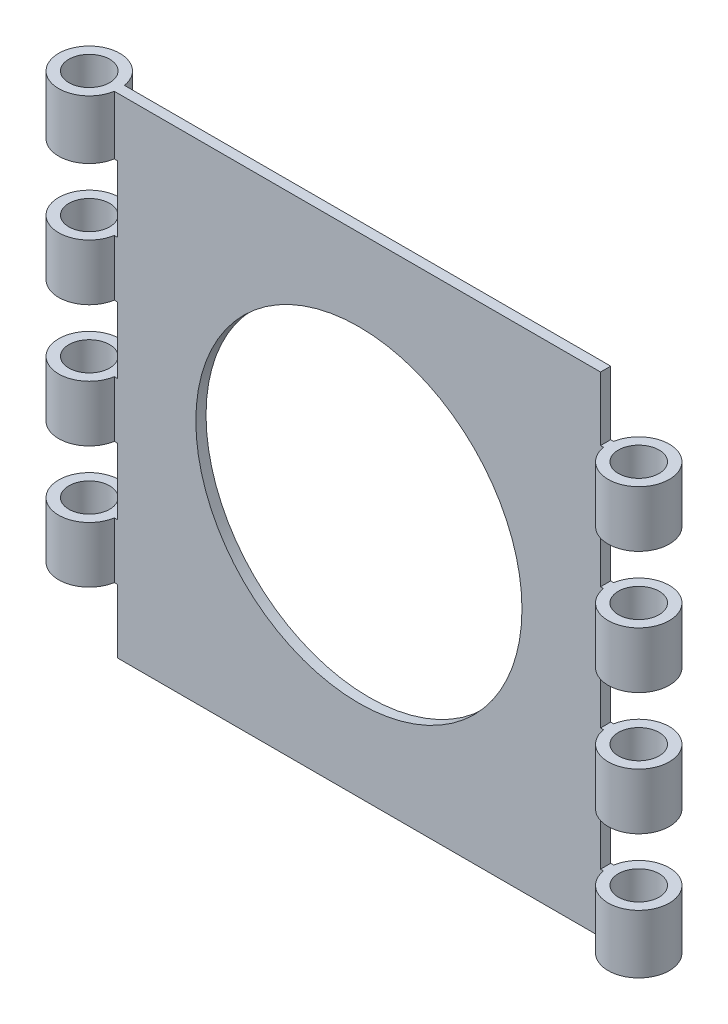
ISO-10303-21;
HEADER;
FILE_DESCRIPTION(('STEP AP214'),'2;1');
FILE_NAME('part.step','',(''),(''),'','','');
FILE_SCHEMA(('AUTOMOTIVE_DESIGN { 1 0 10303 214 1 1 1 1 }'));
ENDSEC;
DATA;
#1=APPLICATION_CONTEXT('core data for automotive mechanical design processes');
#2=APPLICATION_PROTOCOL_DEFINITION('international standard','automotive_design',2000,#1);
#3=PRODUCT_CONTEXT('',#1,'mechanical');
#4=PRODUCT('Part','Part','',(#3));
#5=PRODUCT_RELATED_PRODUCT_CATEGORY('part','',(#4));
#6=PRODUCT_DEFINITION_FORMATION('','',#4);
#7=PRODUCT_DEFINITION_CONTEXT('part definition',#1,'design');
#8=PRODUCT_DEFINITION('design','',#6,#7);
#9=PRODUCT_DEFINITION_SHAPE('','',#8);
#10=(LENGTH_UNIT() NAMED_UNIT(*) SI_UNIT(.MILLI.,.METRE.));
#11=(NAMED_UNIT(*) PLANE_ANGLE_UNIT() SI_UNIT($,.RADIAN.));
#12=(NAMED_UNIT(*) SI_UNIT($,.STERADIAN.) SOLID_ANGLE_UNIT());
#13=UNCERTAINTY_MEASURE_WITH_UNIT(LENGTH_MEASURE(1.E-05),#10,'distance_accuracy_value','');
#14=(GEOMETRIC_REPRESENTATION_CONTEXT(3) GLOBAL_UNCERTAINTY_ASSIGNED_CONTEXT((#13)) GLOBAL_UNIT_ASSIGNED_CONTEXT((#10,
#11,#12)) REPRESENTATION_CONTEXT('',''));
#15=CARTESIAN_POINT('',(0.,0.,0.));
#16=DIRECTION('',(0.,0.,1.));
#17=DIRECTION('',(1.,0.,0.));
#18=AXIS2_PLACEMENT_3D('',#15,#16,#17);
#19=CARTESIAN_POINT('',(-4.69588832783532,76.1999999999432,0.79375));
#20=DIRECTION('',(0.,-1.,0.));
#21=DIRECTION('',(0.,0.,-1.));
#22=AXIS2_PLACEMENT_3D('',#19,#20,#21);
#23=CYLINDRICAL_SURFACE('',#22,4.7625);
#24=DIRECTION('',(0.,1.,0.));
#25=VECTOR('',#24,1.);
#26=CARTESIAN_POINT('',(0.,0.,1.5875));
#27=LINE('',#26,#25);
#28=CARTESIAN_POINT('',(0.,48.0218750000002,1.5875));
#29=VERTEX_POINT('',#28);
#30=CARTESIAN_POINT('',(0.,56.7531250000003,1.5875));
#31=VERTEX_POINT('',#30);
#32=EDGE_CURVE('E535',#29,#31,#27,.T.);
#33=ORIENTED_EDGE('',*,*,#32,.T.);
#34=CARTESIAN_POINT('',(-4.69588832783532,56.7531250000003,0.79375));
#35=DIRECTION('',(0.,1.,0.));
#36=DIRECTION('',(-1.,0.,0.));
#37=AXIS2_PLACEMENT_3D('',#34,#35,#36);
#38=CIRCLE('',#37,4.7625);
#39=CARTESIAN_POINT('',(0.,56.7531250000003,0.));
#40=VERTEX_POINT('',#39);
#41=EDGE_CURVE('E517',#31,#40,#38,.F.);
#42=ORIENTED_EDGE('',*,*,#41,.T.);
#43=DIRECTION('',(0.,1.,0.));
#44=VECTOR('',#43,1.);
#45=CARTESIAN_POINT('',(0.,0.,0.));
#46=LINE('',#45,#44);
#47=CARTESIAN_POINT('',(0.,48.0218750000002,0.));
#48=VERTEX_POINT('',#47);
#49=EDGE_CURVE('E557',#48,#40,#46,.T.);
#50=ORIENTED_EDGE('',*,*,#49,.F.);
#51=CARTESIAN_POINT('',(-4.69588832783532,48.0218750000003,0.79375));
#52=DIRECTION('',(0.,-1.,0.));
#53=DIRECTION('',(1.,0.,0.));
#54=AXIS2_PLACEMENT_3D('',#51,#52,#53);
#55=CIRCLE('',#54,4.7625);
#56=EDGE_CURVE('E56',#48,#29,#55,.F.);
#57=ORIENTED_EDGE('',*,*,#56,.T.);
#58=EDGE_LOOP('',(#33,#42,#50,#57));
#59=FACE_BOUND('',#58,.T.);
#60=ADVANCED_FACE('F33',(#59),#23,.T.);
#61=CARTESIAN_POINT('',(-4.69588832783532,67.0718750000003,0.79375));
#62=DIRECTION('',(0.,-1.,0.));
#63=DIRECTION('',(1.,0.,0.));
#64=AXIS2_PLACEMENT_3D('',#61,#62,#63);
#65=CIRCLE('',#64,4.7625);
#66=CARTESIAN_POINT('',(0.,67.0718750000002,0.));
#67=VERTEX_POINT('',#66);
#68=CARTESIAN_POINT('',(0.,67.0718750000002,1.5875));
#69=VERTEX_POINT('',#68);
#70=EDGE_CURVE('E48',#67,#69,#65,.F.);
#71=ORIENTED_EDGE('',*,*,#70,.T.);
#72=CARTESIAN_POINT('',(0.,76.1999999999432,1.5875));
#73=VERTEX_POINT('',#72);
#74=EDGE_CURVE('E330',#69,#73,#27,.T.);
#75=ORIENTED_EDGE('',*,*,#74,.T.);
#76=CARTESIAN_POINT('',(-4.69588832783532,76.1999999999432,0.79375));
#77=DIRECTION('',(0.,-1.,0.));
#78=DIRECTION('',(0.,0.,-1.));
#79=AXIS2_PLACEMENT_3D('',#76,#77,#78);
#80=CIRCLE('',#79,4.7625);
#81=CARTESIAN_POINT('',(0.,76.2,0.));
#82=VERTEX_POINT('',#81);
#83=EDGE_CURVE('E349',#73,#82,#80,.T.);
#84=ORIENTED_EDGE('',*,*,#83,.T.);
#85=EDGE_CURVE('E345',#67,#82,#46,.T.);
#86=ORIENTED_EDGE('',*,*,#85,.F.);
#87=EDGE_LOOP('',(#71,#75,#84,#86));
#88=FACE_BOUND('',#87,.T.);
#89=ADVANCED_FACE('F561',(#88),#23,.T.);
#90=CARTESIAN_POINT('',(-4.69588832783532,76.2,0.79375));
#91=DIRECTION('',(0.,-1.,0.));
#92=DIRECTION('',(0.,0.,-1.));
#93=AXIS2_PLACEMENT_3D('',#90,#91,#92);
#94=CYLINDRICAL_SURFACE('',#93,3.175);
#95=CARTESIAN_POINT('',(-4.69588832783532,48.0218750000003,0.79375));
#96=DIRECTION('',(0.,-1.,0.));
#97=DIRECTION('',(1.,0.,0.));
#98=AXIS2_PLACEMENT_3D('',#95,#96,#97);
#99=CIRCLE('',#98,3.175);
#100=CARTESIAN_POINT('',(-1.52088832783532,48.0218750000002,0.79375));
#101=VERTEX_POINT('',#100);
#102=EDGE_CURVE('E499',#101,#101,#99,.F.);
#103=ORIENTED_EDGE('',*,*,#102,.F.);
#104=EDGE_LOOP('',(#103));
#105=FACE_BOUND('',#104,.T.);
#106=CARTESIAN_POINT('',(-4.69588832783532,56.7531250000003,0.79375));
#107=DIRECTION('',(0.,1.,0.));
#108=DIRECTION('',(-1.,0.,0.));
#109=AXIS2_PLACEMENT_3D('',#106,#107,#108);
#110=CIRCLE('',#109,3.175);
#111=CARTESIAN_POINT('',(-7.87088832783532,56.7531250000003,0.79375));
#112=VERTEX_POINT('',#111);
#113=EDGE_CURVE('E512',#112,#112,#110,.F.);
#114=ORIENTED_EDGE('',*,*,#113,.F.);
#115=EDGE_LOOP('',(#114));
#116=FACE_BOUND('',#115,.T.);
#117=ADVANCED_FACE('F563',(#105,#116),#94,.F.);
#118=CARTESIAN_POINT('',(-4.69588832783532,76.2,0.79375));
#119=DIRECTION('',(0.,-1.,0.));
#120=DIRECTION('',(0.,0.,-1.));
#121=AXIS2_PLACEMENT_3D('',#118,#119,#120);
#122=CIRCLE('',#121,3.175);
#123=CARTESIAN_POINT('',(-4.69588832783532,76.2,-2.38125));
#124=VERTEX_POINT('',#123);
#125=EDGE_CURVE('E361',#124,#124,#122,.T.);
#126=ORIENTED_EDGE('',*,*,#125,.F.);
#127=EDGE_LOOP('',(#126));
#128=FACE_BOUND('',#127,.T.);
#129=CARTESIAN_POINT('',(-4.69588832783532,67.0718750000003,0.79375));
#130=DIRECTION('',(0.,-1.,0.));
#131=DIRECTION('',(1.,0.,0.));
#132=AXIS2_PLACEMENT_3D('',#129,#130,#131);
#133=CIRCLE('',#132,3.175);
#134=CARTESIAN_POINT('',(-1.52088832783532,67.0718750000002,0.79375));
#135=VERTEX_POINT('',#134);
#136=EDGE_CURVE('E519',#135,#135,#133,.F.);
#137=ORIENTED_EDGE('',*,*,#136,.F.);
#138=EDGE_LOOP('',(#137));
#139=FACE_BOUND('',#138,.T.);
#140=ADVANCED_FACE('F569',(#128,#139),#94,.F.);
#141=CARTESIAN_POINT('',(0.,0.,1.5875));
#142=DIRECTION('',(0.,0.,-1.));
#143=DIRECTION('',(-1.,0.,0.));
#144=AXIS2_PLACEMENT_3D('',#141,#142,#143);
#145=PLANE('',#144);
#146=CARTESIAN_POINT('',(38.1000000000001,38.1,1.5875));
#147=DIRECTION('',(0.,0.,-1.));
#148=DIRECTION('',(-1.,0.,0.));
#149=AXIS2_PLACEMENT_3D('',#146,#147,#148);
#150=CIRCLE('',#149,25.4);
#151=CARTESIAN_POINT('',(12.7000000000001,38.1,1.5875));
#152=VERTEX_POINT('',#151);
#153=EDGE_CURVE('E352',#152,#152,#150,.T.);
#154=ORIENTED_EDGE('',*,*,#153,.T.);
#155=EDGE_LOOP('',(#154));
#156=FACE_BOUND('',#155,.T.);
#157=DIRECTION('',(1.,0.,0.));
#158=VECTOR('',#157,1.);
#159=CARTESIAN_POINT('',(3.96305183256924E-13,56.7531250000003,1.5875));
#160=LINE('',#159,#158);
#161=CARTESIAN_POINT('',(0.463486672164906,56.7531250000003,1.5875));
#162=VERTEX_POINT('',#161);
#163=EDGE_CURVE('E515',#31,#162,#160,.T.);
#164=ORIENTED_EDGE('',*,*,#163,.F.);
#165=ORIENTED_EDGE('',*,*,#32,.F.);
#166=DIRECTION('',(-1.,0.,0.));
#167=VECTOR('',#166,1.);
#168=CARTESIAN_POINT('',(3.35335155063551E-13,48.0218750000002,1.5875));
#169=LINE('',#168,#167);
#170=CARTESIAN_POINT('',(0.463486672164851,48.0218750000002,1.5875));
#171=VERTEX_POINT('',#170);
#172=EDGE_CURVE('E502',#171,#29,#169,.T.);
#173=ORIENTED_EDGE('',*,*,#172,.F.);
#174=DIRECTION('',(0.,-1.,0.));
#175=VECTOR('',#174,1.);
#176=CARTESIAN_POINT('',(0.463486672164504,0.,1.5875));
#177=LINE('',#176,#175);
#178=CARTESIAN_POINT('',(0.463486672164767,37.7031250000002,1.5875));
#179=VERTEX_POINT('',#178);
#180=EDGE_CURVE('E487',#171,#179,#177,.T.);
#181=ORIENTED_EDGE('',*,*,#180,.T.);
#182=DIRECTION('',(1.,0.,0.));
#183=VECTOR('',#182,1.);
#184=CARTESIAN_POINT('',(2.63279667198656E-13,37.7031250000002,1.5875));
#185=LINE('',#184,#183);
#186=CARTESIAN_POINT('',(0.,37.7031250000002,1.5875));
#187=VERTEX_POINT('',#186);
#188=EDGE_CURVE('E495',#187,#179,#185,.T.);
#189=ORIENTED_EDGE('',*,*,#188,.F.);
#190=CARTESIAN_POINT('',(0.,28.9718750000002,1.5875));
#191=VERTEX_POINT('',#190);
#192=EDGE_CURVE('E329',#191,#187,#27,.T.);
#193=ORIENTED_EDGE('',*,*,#192,.F.);
#194=DIRECTION('',(-1.,0.,0.));
#195=VECTOR('',#194,1.);
#196=CARTESIAN_POINT('',(2.02309639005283E-13,28.9718750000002,1.5875));
#197=LINE('',#196,#195);
#198=CARTESIAN_POINT('',(0.463486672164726,28.9718750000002,1.5875));
#199=VERTEX_POINT('',#198);
#200=EDGE_CURVE('E478',#199,#191,#197,.T.);
#201=ORIENTED_EDGE('',*,*,#200,.F.);
#202=DIRECTION('',(0.,-1.,0.));
#203=VECTOR('',#202,1.);
#204=CARTESIAN_POINT('',(0.463486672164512,0.,1.5875));
#205=LINE('',#204,#203);
#206=CARTESIAN_POINT('',(0.463486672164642,18.6531250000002,1.5875));
#207=VERTEX_POINT('',#206);
#208=EDGE_CURVE('E465',#199,#207,#205,.T.);
#209=ORIENTED_EDGE('',*,*,#208,.T.);
#210=DIRECTION('',(1.,0.,0.));
#211=VECTOR('',#210,1.);
#212=CARTESIAN_POINT('',(1.30254151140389E-13,18.6531250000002,1.5875));
#213=LINE('',#212,#211);
#214=CARTESIAN_POINT('',(0.,18.6531250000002,1.5875));
#215=VERTEX_POINT('',#214);
#216=EDGE_CURVE('E471',#215,#207,#213,.T.);
#217=ORIENTED_EDGE('',*,*,#216,.F.);
#218=CARTESIAN_POINT('',(0.,9.92187500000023,1.5875));
#219=VERTEX_POINT('',#218);
#220=EDGE_CURVE('E326',#219,#215,#27,.T.);
#221=ORIENTED_EDGE('',*,*,#220,.F.);
#222=DIRECTION('',(-1.,0.,0.));
#223=VECTOR('',#222,1.);
#224=CARTESIAN_POINT('',(0.,9.92187500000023,1.5875));
#225=LINE('',#224,#223);
#226=CARTESIAN_POINT('',(0.463486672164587,9.92187500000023,1.5875));
#227=VERTEX_POINT('',#226);
#228=EDGE_CURVE('E456',#227,#219,#225,.T.);
#229=ORIENTED_EDGE('',*,*,#228,.F.);
#230=DIRECTION('',(0.,-1.,0.));
#231=VECTOR('',#230,1.);
#232=CARTESIAN_POINT('',(0.463486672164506,0.,1.5875));
#233=LINE('',#232,#231);
#234=CARTESIAN_POINT('',(0.463486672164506,0.,1.5875));
#235=VERTEX_POINT('',#234);
#236=EDGE_CURVE('E449',#227,#235,#233,.T.);
#237=ORIENTED_EDGE('',*,*,#236,.T.);
#238=DIRECTION('',(1.,0.,0.));
#239=VECTOR('',#238,1.);
#240=CARTESIAN_POINT('',(0.,0.,1.5875));
#241=LINE('',#240,#239);
#242=CARTESIAN_POINT('',(76.2,0.,1.5875));
#243=VERTEX_POINT('',#242);
#244=EDGE_CURVE('E311',#235,#243,#241,.T.);
#245=ORIENTED_EDGE('',*,*,#244,.T.);
#246=DIRECTION('',(0.,-1.,0.));
#247=VECTOR('',#246,1.);
#248=CARTESIAN_POINT('',(76.2,76.2,1.5875));
#249=LINE('',#248,#247);
#250=CARTESIAN_POINT('',(76.2,9.12812500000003,1.5875));
#251=VERTEX_POINT('',#250);
#252=EDGE_CURVE('E322',#251,#243,#249,.T.);
#253=ORIENTED_EDGE('',*,*,#252,.F.);
#254=DIRECTION('',(1.,0.,0.));
#255=VECTOR('',#254,1.);
#256=CARTESIAN_POINT('',(0.,9.12812500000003,1.5875));
#257=LINE('',#256,#255);
#258=CARTESIAN_POINT('',(75.7365133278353,9.12812500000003,1.5875));
#259=VERTEX_POINT('',#258);
#260=EDGE_CURVE('E440',#259,#251,#257,.T.);
#261=ORIENTED_EDGE('',*,*,#260,.F.);
#262=DIRECTION('',(0.,1.,0.));
#263=VECTOR('',#262,1.);
#264=CARTESIAN_POINT('',(75.7365133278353,0.,1.5875));
#265=LINE('',#264,#263);
#266=CARTESIAN_POINT('',(75.7365133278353,19.446875,1.5875));
#267=VERTEX_POINT('',#266);
#268=EDGE_CURVE('E425',#259,#267,#265,.T.);
#269=ORIENTED_EDGE('',*,*,#268,.T.);
#270=DIRECTION('',(-1.,0.,0.));
#271=VECTOR('',#270,1.);
#272=CARTESIAN_POINT('',(0.,19.446875,1.5875));
#273=LINE('',#272,#271);
#274=CARTESIAN_POINT('',(76.2,19.446875,1.5875));
#275=VERTEX_POINT('',#274);
#276=EDGE_CURVE('E433',#275,#267,#273,.T.);
#277=ORIENTED_EDGE('',*,*,#276,.F.);
#278=CARTESIAN_POINT('',(76.2,28.178125,1.5875));
#279=VERTEX_POINT('',#278);
#280=EDGE_CURVE('E622',#279,#275,#249,.T.);
#281=ORIENTED_EDGE('',*,*,#280,.F.);
#282=DIRECTION('',(1.,0.,0.));
#283=VECTOR('',#282,1.);
#284=CARTESIAN_POINT('',(0.,28.178125,1.5875));
#285=LINE('',#284,#283);
#286=CARTESIAN_POINT('',(75.7365133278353,28.178125,1.5875));
#287=VERTEX_POINT('',#286);
#288=EDGE_CURVE('E416',#287,#279,#285,.T.);
#289=ORIENTED_EDGE('',*,*,#288,.F.);
#290=DIRECTION('',(0.,1.,0.));
#291=VECTOR('',#290,1.);
#292=CARTESIAN_POINT('',(75.7365133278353,0.,1.5875));
#293=LINE('',#292,#291);
#294=CARTESIAN_POINT('',(75.7365133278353,38.496875,1.5875));
#295=VERTEX_POINT('',#294);
#296=EDGE_CURVE('E401',#287,#295,#293,.T.);
#297=ORIENTED_EDGE('',*,*,#296,.T.);
#298=DIRECTION('',(-1.,0.,0.));
#299=VECTOR('',#298,1.);
#300=CARTESIAN_POINT('',(0.,38.496875,1.5875));
#301=LINE('',#300,#299);
#302=CARTESIAN_POINT('',(76.2,38.496875,1.5875));
#303=VERTEX_POINT('',#302);
#304=EDGE_CURVE('E409',#303,#295,#301,.T.);
#305=ORIENTED_EDGE('',*,*,#304,.F.);
#306=CARTESIAN_POINT('',(76.2,47.228125,1.5875));
#307=VERTEX_POINT('',#306);
#308=EDGE_CURVE('E321',#307,#303,#249,.T.);
#309=ORIENTED_EDGE('',*,*,#308,.F.);
#310=DIRECTION('',(1.,0.,0.));
#311=VECTOR('',#310,1.);
#312=CARTESIAN_POINT('',(0.,47.228125,1.5875));
#313=LINE('',#312,#311);
#314=CARTESIAN_POINT('',(75.7365133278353,47.228125,1.5875));
#315=VERTEX_POINT('',#314);
#316=EDGE_CURVE('E392',#315,#307,#313,.T.);
#317=ORIENTED_EDGE('',*,*,#316,.F.);
#318=DIRECTION('',(0.,1.,0.));
#319=VECTOR('',#318,1.);
#320=CARTESIAN_POINT('',(75.7365133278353,0.,1.5875));
#321=LINE('',#320,#319);
#322=CARTESIAN_POINT('',(75.7365133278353,57.546875,1.5875));
#323=VERTEX_POINT('',#322);
#324=EDGE_CURVE('E379',#315,#323,#321,.T.);
#325=ORIENTED_EDGE('',*,*,#324,.T.);
#326=DIRECTION('',(-1.,0.,0.));
#327=VECTOR('',#326,1.);
#328=CARTESIAN_POINT('',(0.,57.546875,1.5875));
#329=LINE('',#328,#327);
#330=CARTESIAN_POINT('',(76.2,57.546875,1.5875));
#331=VERTEX_POINT('',#330);
#332=EDGE_CURVE('E385',#331,#323,#329,.T.);
#333=ORIENTED_EDGE('',*,*,#332,.F.);
#334=CARTESIAN_POINT('',(76.2,66.278125,1.5875));
#335=VERTEX_POINT('',#334);
#336=EDGE_CURVE('E318',#335,#331,#249,.T.);
#337=ORIENTED_EDGE('',*,*,#336,.F.);
#338=DIRECTION('',(1.,0.,0.));
#339=VECTOR('',#338,1.);
#340=CARTESIAN_POINT('',(0.,66.278125,1.5875));
#341=LINE('',#340,#339);
#342=CARTESIAN_POINT('',(75.7365133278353,66.278125,1.5875));
#343=VERTEX_POINT('',#342);
#344=EDGE_CURVE('E370',#343,#335,#341,.T.);
#345=ORIENTED_EDGE('',*,*,#344,.F.);
#346=DIRECTION('',(0.,1.,0.));
#347=VECTOR('',#346,1.);
#348=CARTESIAN_POINT('',(75.7365133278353,0.,1.5875));
#349=LINE('',#348,#347);
#350=CARTESIAN_POINT('',(75.7365133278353,76.2,1.5875));
#351=VERTEX_POINT('',#350);
#352=EDGE_CURVE('E364',#343,#351,#349,.T.);
#353=ORIENTED_EDGE('',*,*,#352,.T.);
#354=DIRECTION('',(-1.,0.,0.));
#355=VECTOR('',#354,1.);
#356=CARTESIAN_POINT('',(76.2,76.2,1.5875));
#357=LINE('',#356,#355);
#358=EDGE_CURVE('E323',#351,#73,#357,.T.);
#359=ORIENTED_EDGE('',*,*,#358,.T.);
#360=ORIENTED_EDGE('',*,*,#74,.F.);
#361=DIRECTION('',(-1.,0.,0.));
#362=VECTOR('',#361,1.);
#363=CARTESIAN_POINT('',(4.68360671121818E-13,67.0718750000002,1.5875));
#364=LINE('',#363,#362);
#365=CARTESIAN_POINT('',(0.463486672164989,67.0718750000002,1.5875));
#366=VERTEX_POINT('',#365);
#367=EDGE_CURVE('E522',#366,#69,#364,.T.);
#368=ORIENTED_EDGE('',*,*,#367,.F.);
#369=DIRECTION('',(0.,-1.,0.));
#370=VECTOR('',#369,1.);
#371=CARTESIAN_POINT('',(0.46348667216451,0.,1.5875));
#372=LINE('',#371,#370);
#373=EDGE_CURVE('E256',#366,#162,#372,.T.);
#374=ORIENTED_EDGE('',*,*,#373,.T.);
#375=EDGE_LOOP('',(#164,#165,#173,#181,#189,#193,#201,#209,#217,#221,#229,#237,#245,#253,#261,
#269,#277,#281,#289,#297,#305,#309,#317,#325,#333,#337,#345,#353,#359,#360,#368,#374));
#376=FACE_BOUND('',#375,.T.);
#377=ADVANCED_FACE('F528',(#156,#376),#145,.F.);
#378=CARTESIAN_POINT('',(0.,0.,0.));
#379=DIRECTION('',(0.,0.,-1.));
#380=DIRECTION('',(-1.,0.,0.));
#381=AXIS2_PLACEMENT_3D('',#378,#379,#380);
#382=PLANE('',#381);
#383=CARTESIAN_POINT('',(38.1000000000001,38.1,0.));
#384=DIRECTION('',(0.,0.,-1.));
#385=DIRECTION('',(-1.,0.,0.));
#386=AXIS2_PLACEMENT_3D('',#383,#384,#385);
#387=CIRCLE('',#386,25.4);
#388=CARTESIAN_POINT('',(12.7000000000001,38.1,0.));
#389=VERTEX_POINT('',#388);
#390=EDGE_CURVE('E355',#389,#389,#387,.T.);
#391=ORIENTED_EDGE('',*,*,#390,.F.);
#392=EDGE_LOOP('',(#391));
#393=FACE_BOUND('',#392,.T.);
#394=ORIENTED_EDGE('',*,*,#49,.T.);
#395=DIRECTION('',(1.,0.,0.));
#396=VECTOR('',#395,1.);
#397=CARTESIAN_POINT('',(3.96305183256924E-13,56.7531250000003,0.));
#398=LINE('',#397,#396);
#399=CARTESIAN_POINT('',(0.463486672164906,56.7531250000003,0.));
#400=VERTEX_POINT('',#399);
#401=EDGE_CURVE('E11',#40,#400,#398,.T.);
#402=ORIENTED_EDGE('',*,*,#401,.T.);
#403=DIRECTION('',(0.,-1.,0.));
#404=VECTOR('',#403,1.);
#405=CARTESIAN_POINT('',(0.46348667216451,0.,0.));
#406=LINE('',#405,#404);
#407=CARTESIAN_POINT('',(0.463486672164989,67.0718750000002,0.));
#408=VERTEX_POINT('',#407);
#409=EDGE_CURVE('E41',#408,#400,#406,.T.);
#410=ORIENTED_EDGE('',*,*,#409,.F.);
#411=DIRECTION('',(-1.,0.,0.));
#412=VECTOR('',#411,1.);
#413=CARTESIAN_POINT('',(4.68360671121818E-13,67.0718750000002,0.));
#414=LINE('',#413,#412);
#415=EDGE_CURVE('E240',#408,#67,#414,.T.);
#416=ORIENTED_EDGE('',*,*,#415,.T.);
#417=ORIENTED_EDGE('',*,*,#85,.T.);
#418=DIRECTION('',(-1.,0.,0.));
#419=VECTOR('',#418,1.);
#420=CARTESIAN_POINT('',(76.2,76.2,0.));
#421=LINE('',#420,#419);
#422=CARTESIAN_POINT('',(75.7365133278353,76.2,0.));
#423=VERTEX_POINT('',#422);
#424=EDGE_CURVE('E338',#423,#82,#421,.T.);
#425=ORIENTED_EDGE('',*,*,#424,.F.);
#426=DIRECTION('',(0.,1.,0.));
#427=VECTOR('',#426,1.);
#428=CARTESIAN_POINT('',(75.7365133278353,0.,0.));
#429=LINE('',#428,#427);
#430=CARTESIAN_POINT('',(75.7365133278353,66.278125,0.));
#431=VERTEX_POINT('',#430);
#432=EDGE_CURVE('E309',#431,#423,#429,.T.);
#433=ORIENTED_EDGE('',*,*,#432,.F.);
#434=DIRECTION('',(1.,0.,0.));
#435=VECTOR('',#434,1.);
#436=CARTESIAN_POINT('',(0.,66.278125,0.));
#437=LINE('',#436,#435);
#438=CARTESIAN_POINT('',(76.2,66.278125,0.));
#439=VERTEX_POINT('',#438);
#440=EDGE_CURVE('E373',#431,#439,#437,.T.);
#441=ORIENTED_EDGE('',*,*,#440,.T.);
#442=DIRECTION('',(0.,-1.,0.));
#443=VECTOR('',#442,1.);
#444=CARTESIAN_POINT('',(76.2,76.2,0.));
#445=LINE('',#444,#443);
#446=CARTESIAN_POINT('',(76.2,57.546875,0.));
#447=VERTEX_POINT('',#446);
#448=EDGE_CURVE('E333',#439,#447,#445,.T.);
#449=ORIENTED_EDGE('',*,*,#448,.T.);
#450=DIRECTION('',(-1.,0.,0.));
#451=VECTOR('',#450,1.);
#452=CARTESIAN_POINT('',(0.,57.546875,0.));
#453=LINE('',#452,#451);
#454=CARTESIAN_POINT('',(75.7365133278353,57.546875,0.));
#455=VERTEX_POINT('',#454);
#456=EDGE_CURVE('E301',#447,#455,#453,.T.);
#457=ORIENTED_EDGE('',*,*,#456,.T.);
#458=DIRECTION('',(0.,1.,0.));
#459=VECTOR('',#458,1.);
#460=CARTESIAN_POINT('',(75.7365133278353,0.,0.));
#461=LINE('',#460,#459);
#462=CARTESIAN_POINT('',(75.7365133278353,47.228125,0.));
#463=VERTEX_POINT('',#462);
#464=EDGE_CURVE('E304',#463,#455,#461,.T.);
#465=ORIENTED_EDGE('',*,*,#464,.F.);
#466=DIRECTION('',(1.,0.,0.));
#467=VECTOR('',#466,1.);
#468=CARTESIAN_POINT('',(0.,47.228125,0.));
#469=LINE('',#468,#467);
#470=CARTESIAN_POINT('',(76.2,47.228125,0.));
#471=VERTEX_POINT('',#470);
#472=EDGE_CURVE('E306',#463,#471,#469,.T.);
#473=ORIENTED_EDGE('',*,*,#472,.T.);
#474=CARTESIAN_POINT('',(76.2,38.496875,0.));
#475=VERTEX_POINT('',#474);
#476=EDGE_CURVE('E336',#471,#475,#445,.T.);
#477=ORIENTED_EDGE('',*,*,#476,.T.);
#478=DIRECTION('',(-1.,0.,0.));
#479=VECTOR('',#478,1.);
#480=CARTESIAN_POINT('',(0.,38.496875,0.));
#481=LINE('',#480,#479);
#482=CARTESIAN_POINT('',(75.7365133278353,38.496875,0.));
#483=VERTEX_POINT('',#482);
#484=EDGE_CURVE('E293',#475,#483,#481,.T.);
#485=ORIENTED_EDGE('',*,*,#484,.T.);
#486=DIRECTION('',(0.,1.,0.));
#487=VECTOR('',#486,1.);
#488=CARTESIAN_POINT('',(75.7365133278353,0.,0.));
#489=LINE('',#488,#487);
#490=CARTESIAN_POINT('',(75.7365133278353,28.178125,0.));
#491=VERTEX_POINT('',#490);
#492=EDGE_CURVE('E296',#491,#483,#489,.T.);
#493=ORIENTED_EDGE('',*,*,#492,.F.);
#494=DIRECTION('',(1.,0.,0.));
#495=VECTOR('',#494,1.);
#496=CARTESIAN_POINT('',(0.,28.178125,0.));
#497=LINE('',#496,#495);
#498=CARTESIAN_POINT('',(76.2,28.178125,0.));
#499=VERTEX_POINT('',#498);
#500=EDGE_CURVE('E298',#491,#499,#497,.T.);
#501=ORIENTED_EDGE('',*,*,#500,.T.);
#502=CARTESIAN_POINT('',(76.2,19.446875,0.));
#503=VERTEX_POINT('',#502);
#504=EDGE_CURVE('E647',#499,#503,#445,.T.);
#505=ORIENTED_EDGE('',*,*,#504,.T.);
#506=DIRECTION('',(-1.,0.,0.));
#507=VECTOR('',#506,1.);
#508=CARTESIAN_POINT('',(0.,19.446875,0.));
#509=LINE('',#508,#507);
#510=CARTESIAN_POINT('',(75.7365133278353,19.446875,0.));
#511=VERTEX_POINT('',#510);
#512=EDGE_CURVE('E280',#503,#511,#509,.T.);
#513=ORIENTED_EDGE('',*,*,#512,.T.);
#514=DIRECTION('',(0.,1.,0.));
#515=VECTOR('',#514,1.);
#516=CARTESIAN_POINT('',(75.7365133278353,0.,0.));
#517=LINE('',#516,#515);
#518=CARTESIAN_POINT('',(75.7365133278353,9.12812500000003,0.));
#519=VERTEX_POINT('',#518);
#520=EDGE_CURVE('E288',#519,#511,#517,.T.);
#521=ORIENTED_EDGE('',*,*,#520,.F.);
#522=DIRECTION('',(1.,0.,0.));
#523=VECTOR('',#522,1.);
#524=CARTESIAN_POINT('',(0.,9.12812500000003,0.));
#525=LINE('',#524,#523);
#526=CARTESIAN_POINT('',(76.2,9.12812500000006,0.));
#527=VERTEX_POINT('',#526);
#528=EDGE_CURVE('E290',#519,#527,#525,.T.);
#529=ORIENTED_EDGE('',*,*,#528,.T.);
#530=CARTESIAN_POINT('',(76.2,0.,0.));
#531=VERTEX_POINT('',#530);
#532=EDGE_CURVE('E337',#527,#531,#445,.T.);
#533=ORIENTED_EDGE('',*,*,#532,.T.);
#534=DIRECTION('',(1.,0.,0.));
#535=VECTOR('',#534,1.);
#536=CARTESIAN_POINT('',(0.,0.,0.));
#537=LINE('',#536,#535);
#538=CARTESIAN_POINT('',(0.463486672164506,0.,0.));
#539=VERTEX_POINT('',#538);
#540=EDGE_CURVE('E331',#539,#531,#537,.T.);
#541=ORIENTED_EDGE('',*,*,#540,.F.);
#542=DIRECTION('',(0.,-1.,0.));
#543=VECTOR('',#542,1.);
#544=CARTESIAN_POINT('',(0.463486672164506,0.,0.));
#545=LINE('',#544,#543);
#546=CARTESIAN_POINT('',(0.463486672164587,9.92187500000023,0.));
#547=VERTEX_POINT('',#546);
#548=EDGE_CURVE('E454',#547,#539,#545,.T.);
#549=ORIENTED_EDGE('',*,*,#548,.F.);
#550=DIRECTION('',(-1.,0.,0.));
#551=VECTOR('',#550,1.);
#552=CARTESIAN_POINT('',(0.,9.92187500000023,0.));
#553=LINE('',#552,#551);
#554=CARTESIAN_POINT('',(0.,9.92187500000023,0.));
#555=VERTEX_POINT('',#554);
#556=EDGE_CURVE('E459',#547,#555,#553,.T.);
#557=ORIENTED_EDGE('',*,*,#556,.T.);
#558=CARTESIAN_POINT('',(0.,18.6531250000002,0.));
#559=VERTEX_POINT('',#558);
#560=EDGE_CURVE('E341',#555,#559,#46,.T.);
#561=ORIENTED_EDGE('',*,*,#560,.T.);
#562=DIRECTION('',(1.,0.,0.));
#563=VECTOR('',#562,1.);
#564=CARTESIAN_POINT('',(1.30254151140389E-13,18.6531250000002,0.));
#565=LINE('',#564,#563);
#566=CARTESIAN_POINT('',(0.463486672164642,18.6531250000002,0.));
#567=VERTEX_POINT('',#566);
#568=EDGE_CURVE('E269',#559,#567,#565,.T.);
#569=ORIENTED_EDGE('',*,*,#568,.T.);
#570=DIRECTION('',(0.,-1.,0.));
#571=VECTOR('',#570,1.);
#572=CARTESIAN_POINT('',(0.463486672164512,0.,0.));
#573=LINE('',#572,#571);
#574=CARTESIAN_POINT('',(0.463486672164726,28.9718750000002,0.));
#575=VERTEX_POINT('',#574);
#576=EDGE_CURVE('E272',#575,#567,#573,.T.);
#577=ORIENTED_EDGE('',*,*,#576,.F.);
#578=DIRECTION('',(-1.,0.,0.));
#579=VECTOR('',#578,1.);
#580=CARTESIAN_POINT('',(2.02309639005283E-13,28.9718750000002,0.));
#581=LINE('',#580,#579);
#582=CARTESIAN_POINT('',(0.,28.9718750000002,0.));
#583=VERTEX_POINT('',#582);
#584=EDGE_CURVE('E274',#575,#583,#581,.T.);
#585=ORIENTED_EDGE('',*,*,#584,.T.);
#586=CARTESIAN_POINT('',(0.,37.7031250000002,0.));
#587=VERTEX_POINT('',#586);
#588=EDGE_CURVE('E344',#583,#587,#46,.T.);
#589=ORIENTED_EDGE('',*,*,#588,.T.);
#590=DIRECTION('',(1.,0.,0.));
#591=VECTOR('',#590,1.);
#592=CARTESIAN_POINT('',(2.63279667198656E-13,37.7031250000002,0.));
#593=LINE('',#592,#591);
#594=CARTESIAN_POINT('',(0.463486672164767,37.7031250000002,0.));
#595=VERTEX_POINT('',#594);
#596=EDGE_CURVE('E249',#587,#595,#593,.T.);
#597=ORIENTED_EDGE('',*,*,#596,.T.);
#598=DIRECTION('',(0.,-1.,0.));
#599=VECTOR('',#598,1.);
#600=CARTESIAN_POINT('',(0.463486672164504,0.,0.));
#601=LINE('',#600,#599);
#602=CARTESIAN_POINT('',(0.463486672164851,48.0218750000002,0.));
#603=VERTEX_POINT('',#602);
#604=EDGE_CURVE('E265',#603,#595,#601,.T.);
#605=ORIENTED_EDGE('',*,*,#604,.F.);
#606=DIRECTION('',(-1.,0.,0.));
#607=VECTOR('',#606,1.);
#608=CARTESIAN_POINT('',(3.35335155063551E-13,48.0218750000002,0.));
#609=LINE('',#608,#607);
#610=EDGE_CURVE('E267',#603,#48,#609,.T.);
#611=ORIENTED_EDGE('',*,*,#610,.T.);
#612=EDGE_LOOP('',(#394,#402,#410,#416,#417,#425,#433,#441,#449,#457,#465,#473,#477,#485,#493,
#501,#505,#513,#521,#529,#533,#541,#549,#557,#561,#569,#577,#585,#589,#597,#605,#611));
#613=FACE_BOUND('',#612,.T.);
#614=ADVANCED_FACE('F260',(#393,#613),#382,.T.);
#615=ORIENTED_EDGE('',*,*,#192,.T.);
#616=CARTESIAN_POINT('',(-4.69588832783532,37.7031250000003,0.79375));
#617=DIRECTION('',(0.,1.,0.));
#618=DIRECTION('',(-1.,0.,0.));
#619=AXIS2_PLACEMENT_3D('',#616,#617,#618);
#620=CIRCLE('',#619,4.7625);
#621=EDGE_CURVE('E497',#187,#587,#620,.F.);
#622=ORIENTED_EDGE('',*,*,#621,.T.);
#623=ORIENTED_EDGE('',*,*,#588,.F.);
#624=CARTESIAN_POINT('',(-4.69588832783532,28.9718750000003,0.79375));
#625=DIRECTION('',(0.,-1.,0.));
#626=DIRECTION('',(1.,0.,0.));
#627=AXIS2_PLACEMENT_3D('',#624,#625,#626);
#628=CIRCLE('',#627,4.7625);
#629=EDGE_CURVE('E481',#583,#191,#628,.F.);
#630=ORIENTED_EDGE('',*,*,#629,.T.);
#631=EDGE_LOOP('',(#615,#622,#623,#630));
#632=FACE_BOUND('',#631,.T.);
#633=ADVANCED_FACE('F540',(#632),#23,.T.);
#634=CARTESIAN_POINT('',(-4.69588832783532,28.9718750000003,0.79375));
#635=DIRECTION('',(0.,-1.,0.));
#636=DIRECTION('',(1.,0.,0.));
#637=AXIS2_PLACEMENT_3D('',#634,#635,#636);
#638=CIRCLE('',#637,3.175);
#639=CARTESIAN_POINT('',(-1.52088832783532,28.9718750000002,0.79375));
#640=VERTEX_POINT('',#639);
#641=EDGE_CURVE('E475',#640,#640,#638,.F.);
#642=ORIENTED_EDGE('',*,*,#641,.F.);
#643=EDGE_LOOP('',(#642));
#644=FACE_BOUND('',#643,.T.);
#645=CARTESIAN_POINT('',(-4.69588832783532,37.7031250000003,0.79375));
#646=DIRECTION('',(0.,1.,0.));
#647=DIRECTION('',(-1.,0.,0.));
#648=AXIS2_PLACEMENT_3D('',#645,#646,#647);
#649=CIRCLE('',#648,3.175);
#650=CARTESIAN_POINT('',(-7.87088832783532,37.7031250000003,0.79375));
#651=VERTEX_POINT('',#650);
#652=EDGE_CURVE('E492',#651,#651,#649,.F.);
#653=ORIENTED_EDGE('',*,*,#652,.F.);
#654=EDGE_LOOP('',(#653));
#655=FACE_BOUND('',#654,.T.);
#656=ADVANCED_FACE('F577',(#644,#655),#94,.F.);
#657=ORIENTED_EDGE('',*,*,#220,.T.);
#658=CARTESIAN_POINT('',(-4.69588832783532,18.6531250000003,0.79375));
#659=DIRECTION('',(0.,1.,0.));
#660=DIRECTION('',(-1.,0.,0.));
#661=AXIS2_PLACEMENT_3D('',#658,#659,#660);
#662=CIRCLE('',#661,4.7625);
#663=EDGE_CURVE('E473',#215,#559,#662,.F.);
#664=ORIENTED_EDGE('',*,*,#663,.T.);
#665=ORIENTED_EDGE('',*,*,#560,.F.);
#666=CARTESIAN_POINT('',(-4.69588832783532,9.92187500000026,0.79375));
#667=DIRECTION('',(0.,-1.,0.));
#668=DIRECTION('',(1.,0.,0.));
#669=AXIS2_PLACEMENT_3D('',#666,#667,#668);
#670=CIRCLE('',#669,4.7625);
#671=EDGE_CURVE('E284',#555,#219,#670,.F.);
#672=ORIENTED_EDGE('',*,*,#671,.T.);
#673=EDGE_LOOP('',(#657,#664,#665,#672));
#674=FACE_BOUND('',#673,.T.);
#675=ADVANCED_FACE('F573',(#674),#23,.T.);
#676=CARTESIAN_POINT('',(-4.69588832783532,9.92187500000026,0.79375));
#677=DIRECTION('',(0.,-1.,0.));
#678=DIRECTION('',(1.,0.,0.));
#679=AXIS2_PLACEMENT_3D('',#676,#677,#678);
#680=CIRCLE('',#679,3.175);
#681=CARTESIAN_POINT('',(-1.52088832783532,9.92187500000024,0.79375));
#682=VERTEX_POINT('',#681);
#683=EDGE_CURVE('E281',#682,#682,#680,.F.);
#684=ORIENTED_EDGE('',*,*,#683,.F.);
#685=EDGE_LOOP('',(#684));
#686=FACE_BOUND('',#685,.T.);
#687=CARTESIAN_POINT('',(-4.69588832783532,18.6531250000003,0.79375));
#688=DIRECTION('',(0.,1.,0.));
#689=DIRECTION('',(-1.,0.,0.));
#690=AXIS2_PLACEMENT_3D('',#687,#688,#689);
#691=CIRCLE('',#690,3.175);
#692=CARTESIAN_POINT('',(-7.87088832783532,18.6531250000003,0.79375));
#693=VERTEX_POINT('',#692);
#694=EDGE_CURVE('E468',#693,#693,#691,.F.);
#695=ORIENTED_EDGE('',*,*,#694,.F.);
#696=EDGE_LOOP('',(#695));
#697=FACE_BOUND('',#696,.T.);
#698=ADVANCED_FACE('F572',(#686,#697),#94,.F.);
#699=CARTESIAN_POINT('',(80.8958883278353,0.,0.793750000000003));
#700=DIRECTION('',(0.,1.,0.));
#701=DIRECTION('',(-1.,0.,0.));
#702=AXIS2_PLACEMENT_3D('',#699,#700,#701);
#703=CYLINDRICAL_SURFACE('',#702,4.7625);
#704=ORIENTED_EDGE('',*,*,#280,.T.);
#705=CARTESIAN_POINT('',(80.8958883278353,19.446875,0.793750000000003));
#706=DIRECTION('',(0.,-1.,0.));
#707=DIRECTION('',(0.,0.,-1.));
#708=AXIS2_PLACEMENT_3D('',#705,#706,#707);
#709=CIRCLE('',#708,4.7625);
#710=EDGE_CURVE('E435',#275,#503,#709,.F.);
#711=ORIENTED_EDGE('',*,*,#710,.T.);
#712=ORIENTED_EDGE('',*,*,#504,.F.);
#713=CARTESIAN_POINT('',(80.8958883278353,28.178125,0.793750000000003));
#714=DIRECTION('',(0.,1.,0.));
#715=DIRECTION('',(0.,0.,1.));
#716=AXIS2_PLACEMENT_3D('',#713,#714,#715);
#717=CIRCLE('',#716,4.7625);
#718=EDGE_CURVE('E419',#499,#279,#717,.F.);
#719=ORIENTED_EDGE('',*,*,#718,.T.);
#720=EDGE_LOOP('',(#704,#711,#712,#719));
#721=FACE_BOUND('',#720,.T.);
#722=ADVANCED_FACE('F590',(#721),#703,.T.);
#723=CARTESIAN_POINT('',(80.8958883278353,9.12812500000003,0.793750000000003));
#724=DIRECTION('',(0.,1.,0.));
#725=DIRECTION('',(0.,0.,1.));
#726=AXIS2_PLACEMENT_3D('',#723,#724,#725);
#727=CIRCLE('',#726,4.7625);
#728=EDGE_CURVE('E443',#527,#251,#727,.F.);
#729=ORIENTED_EDGE('',*,*,#728,.T.);
#730=ORIENTED_EDGE('',*,*,#252,.T.);
#731=CARTESIAN_POINT('',(80.8958883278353,0.,0.793750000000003));
#732=DIRECTION('',(0.,1.,0.));
#733=DIRECTION('',(-1.,0.,0.));
#734=AXIS2_PLACEMENT_3D('',#731,#732,#733);
#735=CIRCLE('',#734,4.7625);
#736=EDGE_CURVE('E346',#243,#531,#735,.T.);
#737=ORIENTED_EDGE('',*,*,#736,.T.);
#738=ORIENTED_EDGE('',*,*,#532,.F.);
#739=EDGE_LOOP('',(#729,#730,#737,#738));
#740=FACE_BOUND('',#739,.T.);
#741=ADVANCED_FACE('F620',(#740),#703,.T.);
#742=CARTESIAN_POINT('',(80.8958883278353,76.2,0.793750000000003));
#743=DIRECTION('',(0.,-1.,0.));
#744=DIRECTION('',(0.,0.,-1.));
#745=AXIS2_PLACEMENT_3D('',#742,#743,#744);
#746=CYLINDRICAL_SURFACE('',#745,3.175);
#747=CARTESIAN_POINT('',(80.8958883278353,28.178125,0.793750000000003));
#748=DIRECTION('',(0.,1.,0.));
#749=DIRECTION('',(0.,0.,1.));
#750=AXIS2_PLACEMENT_3D('',#747,#748,#749);
#751=CIRCLE('',#750,3.175);
#752=CARTESIAN_POINT('',(80.8958883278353,28.178125,3.96875));
#753=VERTEX_POINT('',#752);
#754=EDGE_CURVE('E413',#753,#753,#751,.F.);
#755=ORIENTED_EDGE('',*,*,#754,.F.);
#756=EDGE_LOOP('',(#755));
#757=FACE_BOUND('',#756,.T.);
#758=CARTESIAN_POINT('',(80.8958883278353,19.446875,0.793750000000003));
#759=DIRECTION('',(0.,-1.,0.));
#760=DIRECTION('',(0.,0.,-1.));
#761=AXIS2_PLACEMENT_3D('',#758,#759,#760);
#762=CIRCLE('',#761,3.175);
#763=CARTESIAN_POINT('',(80.8958883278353,19.446875,-2.38124999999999));
#764=VERTEX_POINT('',#763);
#765=EDGE_CURVE('E430',#764,#764,#762,.F.);
#766=ORIENTED_EDGE('',*,*,#765,.F.);
#767=EDGE_LOOP('',(#766));
#768=FACE_BOUND('',#767,.T.);
#769=ADVANCED_FACE('F668',(#757,#768),#746,.F.);
#770=CARTESIAN_POINT('',(80.8958883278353,0.,0.793750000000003));
#771=DIRECTION('',(0.,-1.,0.));
#772=DIRECTION('',(0.,0.,-1.));
#773=AXIS2_PLACEMENT_3D('',#770,#771,#772);
#774=CIRCLE('',#773,3.175);
#775=CARTESIAN_POINT('',(80.8958883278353,0.,-2.38124999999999));
#776=VERTEX_POINT('',#775);
#777=EDGE_CURVE('E358',#776,#776,#774,.T.);
#778=ORIENTED_EDGE('',*,*,#777,.T.);
#779=EDGE_LOOP('',(#778));
#780=FACE_BOUND('',#779,.T.);
#781=CARTESIAN_POINT('',(80.8958883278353,9.12812500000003,0.793750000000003));
#782=DIRECTION('',(0.,1.,0.));
#783=DIRECTION('',(0.,0.,1.));
#784=AXIS2_PLACEMENT_3D('',#781,#782,#783);
#785=CIRCLE('',#784,3.175);
#786=CARTESIAN_POINT('',(80.8958883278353,9.12812500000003,3.96875));
#787=VERTEX_POINT('',#786);
#788=EDGE_CURVE('E437',#787,#787,#785,.F.);
#789=ORIENTED_EDGE('',*,*,#788,.F.);
#790=EDGE_LOOP('',(#789));
#791=FACE_BOUND('',#790,.T.);
#792=ADVANCED_FACE('F671',(#780,#791),#746,.F.);
#793=ORIENTED_EDGE('',*,*,#308,.T.);
#794=CARTESIAN_POINT('',(80.8958883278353,38.496875,0.793750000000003));
#795=DIRECTION('',(0.,-1.,0.));
#796=DIRECTION('',(0.,0.,-1.));
#797=AXIS2_PLACEMENT_3D('',#794,#795,#796);
#798=CIRCLE('',#797,4.7625);
#799=EDGE_CURVE('E411',#303,#475,#798,.F.);
#800=ORIENTED_EDGE('',*,*,#799,.T.);
#801=ORIENTED_EDGE('',*,*,#476,.F.);
#802=CARTESIAN_POINT('',(80.8958883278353,47.228125,0.793750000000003));
#803=DIRECTION('',(0.,1.,0.));
#804=DIRECTION('',(0.,0.,1.));
#805=AXIS2_PLACEMENT_3D('',#802,#803,#804);
#806=CIRCLE('',#805,4.7625);
#807=EDGE_CURVE('E395',#471,#307,#806,.F.);
#808=ORIENTED_EDGE('',*,*,#807,.T.);
#809=EDGE_LOOP('',(#793,#800,#801,#808));
#810=FACE_BOUND('',#809,.T.);
#811=ADVANCED_FACE('F629',(#810),#703,.T.);
#812=CARTESIAN_POINT('',(80.8958883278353,47.228125,0.793750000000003));
#813=DIRECTION('',(0.,1.,0.));
#814=DIRECTION('',(0.,0.,1.));
#815=AXIS2_PLACEMENT_3D('',#812,#813,#814);
#816=CIRCLE('',#815,3.175);
#817=CARTESIAN_POINT('',(80.8958883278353,47.228125,3.96875));
#818=VERTEX_POINT('',#817);
#819=EDGE_CURVE('E389',#818,#818,#816,.F.);
#820=ORIENTED_EDGE('',*,*,#819,.F.);
#821=EDGE_LOOP('',(#820));
#822=FACE_BOUND('',#821,.T.);
#823=CARTESIAN_POINT('',(80.8958883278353,38.496875,0.793750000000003));
#824=DIRECTION('',(0.,-1.,0.));
#825=DIRECTION('',(0.,0.,-1.));
#826=AXIS2_PLACEMENT_3D('',#823,#824,#825);
#827=CIRCLE('',#826,3.175);
#828=CARTESIAN_POINT('',(80.8958883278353,38.496875,-2.38124999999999));
#829=VERTEX_POINT('',#828);
#830=EDGE_CURVE('E406',#829,#829,#827,.F.);
#831=ORIENTED_EDGE('',*,*,#830,.F.);
#832=EDGE_LOOP('',(#831));
#833=FACE_BOUND('',#832,.T.);
#834=ADVANCED_FACE('F713',(#822,#833),#746,.F.);
#835=ORIENTED_EDGE('',*,*,#336,.T.);
#836=CARTESIAN_POINT('',(80.8958883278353,57.546875,0.793750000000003));
#837=DIRECTION('',(0.,-1.,0.));
#838=DIRECTION('',(0.,0.,-1.));
#839=AXIS2_PLACEMENT_3D('',#836,#837,#838);
#840=CIRCLE('',#839,4.7625);
#841=EDGE_CURVE('E387',#331,#447,#840,.F.);
#842=ORIENTED_EDGE('',*,*,#841,.T.);
#843=ORIENTED_EDGE('',*,*,#448,.F.);
#844=CARTESIAN_POINT('',(80.8958883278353,66.278125,0.793750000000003));
#845=DIRECTION('',(0.,1.,0.));
#846=DIRECTION('',(0.,0.,1.));
#847=AXIS2_PLACEMENT_3D('',#844,#845,#846);
#848=CIRCLE('',#847,4.7625);
#849=EDGE_CURVE('E315',#439,#335,#848,.F.);
#850=ORIENTED_EDGE('',*,*,#849,.T.);
#851=EDGE_LOOP('',(#835,#842,#843,#850));
#852=FACE_BOUND('',#851,.T.);
#853=ADVANCED_FACE('F711',(#852),#703,.T.);
#854=CARTESIAN_POINT('',(80.8958883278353,66.278125,0.793750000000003));
#855=DIRECTION('',(0.,1.,0.));
#856=DIRECTION('',(0.,0.,1.));
#857=AXIS2_PLACEMENT_3D('',#854,#855,#856);
#858=CIRCLE('',#857,3.175);
#859=CARTESIAN_POINT('',(80.8958883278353,66.278125,3.96875));
#860=VERTEX_POINT('',#859);
#861=EDGE_CURVE('E312',#860,#860,#858,.F.);
#862=ORIENTED_EDGE('',*,*,#861,.F.);
#863=EDGE_LOOP('',(#862));
#864=FACE_BOUND('',#863,.T.);
#865=CARTESIAN_POINT('',(80.8958883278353,57.546875,0.793750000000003));
#866=DIRECTION('',(0.,-1.,0.));
#867=DIRECTION('',(0.,0.,-1.));
#868=AXIS2_PLACEMENT_3D('',#865,#866,#867);
#869=CIRCLE('',#868,3.175);
#870=CARTESIAN_POINT('',(80.8958883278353,57.546875,-2.38124999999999));
#871=VERTEX_POINT('',#870);
#872=EDGE_CURVE('E382',#871,#871,#869,.F.);
#873=ORIENTED_EDGE('',*,*,#872,.F.);
#874=EDGE_LOOP('',(#873));
#875=FACE_BOUND('',#874,.T.);
#876=ADVANCED_FACE('F673',(#864,#875),#746,.F.);
#877=CARTESIAN_POINT('',(0.,0.,1.5875));
#878=DIRECTION('',(0.,1.,0.));
#879=DIRECTION('',(0.,0.,1.));
#880=AXIS2_PLACEMENT_3D('',#877,#878,#879);
#881=PLANE('',#880);
#882=ORIENTED_EDGE('',*,*,#777,.F.);
#883=EDGE_LOOP('',(#882));
#884=FACE_BOUND('',#883,.T.);
#885=ORIENTED_EDGE('',*,*,#244,.F.);
#886=DIRECTION('',(0.,0.,-1.));
#887=VECTOR('',#886,1.);
#888=CARTESIAN_POINT('',(0.463486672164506,0.,1.5875));
#889=LINE('',#888,#887);
#890=EDGE_CURVE('E277',#235,#539,#889,.T.);
#891=ORIENTED_EDGE('',*,*,#890,.T.);
#892=ORIENTED_EDGE('',*,*,#540,.T.);
#893=ORIENTED_EDGE('',*,*,#736,.F.);
#894=EDGE_LOOP('',(#885,#891,#892,#893));
#895=FACE_BOUND('',#894,.T.);
#896=ADVANCED_FACE('F616',(#884,#895),#881,.F.);
#897=CARTESIAN_POINT('',(76.2,76.2,1.5875));
#898=DIRECTION('',(0.,-1.,0.));
#899=DIRECTION('',(1.,0.,0.));
#900=AXIS2_PLACEMENT_3D('',#897,#898,#899);
#901=PLANE('',#900);
#902=ORIENTED_EDGE('',*,*,#125,.T.);
#903=EDGE_LOOP('',(#902));
#904=FACE_BOUND('',#903,.T.);
#905=ORIENTED_EDGE('',*,*,#358,.F.);
#906=DIRECTION('',(0.,0.,-1.));
#907=VECTOR('',#906,1.);
#908=CARTESIAN_POINT('',(75.7365133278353,76.2,1.5875));
#909=LINE('',#908,#907);
#910=EDGE_CURVE('E367',#351,#423,#909,.T.);
#911=ORIENTED_EDGE('',*,*,#910,.T.);
#912=ORIENTED_EDGE('',*,*,#424,.T.);
#913=ORIENTED_EDGE('',*,*,#83,.F.);
#914=EDGE_LOOP('',(#905,#911,#912,#913));
#915=FACE_BOUND('',#914,.T.);
#916=ADVANCED_FACE('F35',(#904,#915),#901,.F.);
#917=CARTESIAN_POINT('',(38.1000000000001,38.1,5.55625));
#918=DIRECTION('',(0.,0.,-1.));
#919=DIRECTION('',(-1.,0.,0.));
#920=AXIS2_PLACEMENT_3D('',#917,#918,#919);
#921=CYLINDRICAL_SURFACE('',#920,25.4);
#922=ORIENTED_EDGE('',*,*,#390,.T.);
#923=EDGE_LOOP('',(#922));
#924=FACE_BOUND('',#923,.T.);
#925=ORIENTED_EDGE('',*,*,#153,.F.);
#926=EDGE_LOOP('',(#925));
#927=FACE_BOUND('',#926,.T.);
#928=ADVANCED_FACE('F708',(#924,#927),#921,.F.);
#929=CARTESIAN_POINT('',(75.7365133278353,76.596875,-3.96875));
#930=DIRECTION('',(-1.,0.,0.));
#931=DIRECTION('',(0.,0.,1.));
#932=AXIS2_PLACEMENT_3D('',#929,#930,#931);
#933=PLANE('',#932);
#934=DIRECTION('',(0.,0.,1.));
#935=VECTOR('',#934,1.);
#936=CARTESIAN_POINT('',(75.7365133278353,66.278125,-3.96875));
#937=LINE('',#936,#935);
#938=EDGE_CURVE('E316',#431,#343,#937,.T.);
#939=ORIENTED_EDGE('',*,*,#938,.F.);
#940=ORIENTED_EDGE('',*,*,#432,.T.);
#941=ORIENTED_EDGE('',*,*,#910,.F.);
#942=ORIENTED_EDGE('',*,*,#352,.F.);
#943=EDGE_LOOP('',(#939,#940,#941,#942));
#944=FACE_BOUND('',#943,.T.);
#945=ADVANCED_FACE('F705',(#944),#933,.F.);
#946=CARTESIAN_POINT('',(86.0552633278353,66.278125,-3.96875));
#947=DIRECTION('',(0.,1.,0.));
#948=DIRECTION('',(0.,0.,1.));
#949=AXIS2_PLACEMENT_3D('',#946,#947,#948);
#950=PLANE('',#949);
#951=ORIENTED_EDGE('',*,*,#861,.T.);
#952=EDGE_LOOP('',(#951));
#953=FACE_BOUND('',#952,.T.);
#954=ORIENTED_EDGE('',*,*,#344,.T.);
#955=ORIENTED_EDGE('',*,*,#849,.F.);
#956=ORIENTED_EDGE('',*,*,#440,.F.);
#957=ORIENTED_EDGE('',*,*,#938,.T.);
#958=EDGE_LOOP('',(#954,#955,#956,#957));
#959=FACE_BOUND('',#958,.T.);
#960=ADVANCED_FACE('F701',(#953,#959),#950,.T.);
#961=CARTESIAN_POINT('',(75.7365133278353,57.546875,-3.96875));
#962=DIRECTION('',(-1.,0.,0.));
#963=DIRECTION('',(0.,0.,1.));
#964=AXIS2_PLACEMENT_3D('',#961,#962,#963);
#965=PLANE('',#964);
#966=DIRECTION('',(0.,0.,1.));
#967=VECTOR('',#966,1.);
#968=CARTESIAN_POINT('',(75.7365133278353,47.228125,-3.96875));
#969=LINE('',#968,#967);
#970=EDGE_CURVE('E398',#463,#315,#969,.T.);
#971=ORIENTED_EDGE('',*,*,#970,.F.);
#972=ORIENTED_EDGE('',*,*,#464,.T.);
#973=DIRECTION('',(0.,0.,1.));
#974=VECTOR('',#973,1.);
#975=CARTESIAN_POINT('',(75.7365133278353,57.546875,-3.96875));
#976=LINE('',#975,#974);
#977=EDGE_CURVE('E397',#455,#323,#976,.T.);
#978=ORIENTED_EDGE('',*,*,#977,.T.);
#979=ORIENTED_EDGE('',*,*,#324,.F.);
#980=EDGE_LOOP('',(#971,#972,#978,#979));
#981=FACE_BOUND('',#980,.T.);
#982=ADVANCED_FACE('F694',(#981),#965,.F.);
#983=CARTESIAN_POINT('',(75.7365133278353,57.546875,-3.96875));
#984=DIRECTION('',(0.,-1.,0.));
#985=DIRECTION('',(0.,0.,-1.));
#986=AXIS2_PLACEMENT_3D('',#983,#984,#985);
#987=PLANE('',#986);
#988=ORIENTED_EDGE('',*,*,#332,.T.);
#989=ORIENTED_EDGE('',*,*,#977,.F.);
#990=ORIENTED_EDGE('',*,*,#456,.F.);
#991=ORIENTED_EDGE('',*,*,#841,.F.);
#992=EDGE_LOOP('',(#988,#989,#990,#991));
#993=FACE_BOUND('',#992,.T.);
#994=ORIENTED_EDGE('',*,*,#872,.T.);
#995=EDGE_LOOP('',(#994));
#996=FACE_BOUND('',#995,.T.);
#997=ADVANCED_FACE('F691',(#993,#996),#987,.T.);
#998=CARTESIAN_POINT('',(86.0552633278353,47.228125,-3.96875));
#999=DIRECTION('',(0.,1.,0.));
#1000=DIRECTION('',(0.,0.,1.));
#1001=AXIS2_PLACEMENT_3D('',#998,#999,#1000);
#1002=PLANE('',#1001);
#1003=ORIENTED_EDGE('',*,*,#316,.T.);
#1004=ORIENTED_EDGE('',*,*,#807,.F.);
#1005=ORIENTED_EDGE('',*,*,#472,.F.);
#1006=ORIENTED_EDGE('',*,*,#970,.T.);
#1007=EDGE_LOOP('',(#1003,#1004,#1005,#1006));
#1008=FACE_BOUND('',#1007,.T.);
#1009=ORIENTED_EDGE('',*,*,#819,.T.);
#1010=EDGE_LOOP('',(#1009));
#1011=FACE_BOUND('',#1010,.T.);
#1012=ADVANCED_FACE('F690',(#1008,#1011),#1002,.T.);
#1013=CARTESIAN_POINT('',(75.7365133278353,38.496875,-3.96875));
#1014=DIRECTION('',(-1.,0.,0.));
#1015=DIRECTION('',(0.,0.,1.));
#1016=AXIS2_PLACEMENT_3D('',#1013,#1014,#1015);
#1017=PLANE('',#1016);
#1018=DIRECTION('',(0.,0.,1.));
#1019=VECTOR('',#1018,1.);
#1020=CARTESIAN_POINT('',(75.7365133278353,28.178125,-3.96875));
#1021=LINE('',#1020,#1019);
#1022=EDGE_CURVE('E422',#491,#287,#1021,.T.);
#1023=ORIENTED_EDGE('',*,*,#1022,.F.);
#1024=ORIENTED_EDGE('',*,*,#492,.T.);
#1025=DIRECTION('',(0.,0.,1.));
#1026=VECTOR('',#1025,1.);
#1027=CARTESIAN_POINT('',(75.7365133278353,38.496875,-3.96875));
#1028=LINE('',#1027,#1026);
#1029=EDGE_CURVE('E421',#483,#295,#1028,.T.);
#1030=ORIENTED_EDGE('',*,*,#1029,.T.);
#1031=ORIENTED_EDGE('',*,*,#296,.F.);
#1032=EDGE_LOOP('',(#1023,#1024,#1030,#1031));
#1033=FACE_BOUND('',#1032,.T.);
#1034=ADVANCED_FACE('F641',(#1033),#1017,.F.);
#1035=CARTESIAN_POINT('',(75.7365133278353,38.496875,-3.96875));
#1036=DIRECTION('',(0.,-1.,0.));
#1037=DIRECTION('',(0.,0.,-1.));
#1038=AXIS2_PLACEMENT_3D('',#1035,#1036,#1037);
#1039=PLANE('',#1038);
#1040=ORIENTED_EDGE('',*,*,#304,.T.);
#1041=ORIENTED_EDGE('',*,*,#1029,.F.);
#1042=ORIENTED_EDGE('',*,*,#484,.F.);
#1043=ORIENTED_EDGE('',*,*,#799,.F.);
#1044=EDGE_LOOP('',(#1040,#1041,#1042,#1043));
#1045=FACE_BOUND('',#1044,.T.);
#1046=ORIENTED_EDGE('',*,*,#830,.T.);
#1047=EDGE_LOOP('',(#1046));
#1048=FACE_BOUND('',#1047,.T.);
#1049=ADVANCED_FACE('F637',(#1045,#1048),#1039,.T.);
#1050=CARTESIAN_POINT('',(86.0552633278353,28.178125,-3.96875));
#1051=DIRECTION('',(0.,1.,0.));
#1052=DIRECTION('',(0.,0.,1.));
#1053=AXIS2_PLACEMENT_3D('',#1050,#1051,#1052);
#1054=PLANE('',#1053);
#1055=ORIENTED_EDGE('',*,*,#288,.T.);
#1056=ORIENTED_EDGE('',*,*,#718,.F.);
#1057=ORIENTED_EDGE('',*,*,#500,.F.);
#1058=ORIENTED_EDGE('',*,*,#1022,.T.);
#1059=EDGE_LOOP('',(#1055,#1056,#1057,#1058));
#1060=FACE_BOUND('',#1059,.T.);
#1061=ORIENTED_EDGE('',*,*,#754,.T.);
#1062=EDGE_LOOP('',(#1061));
#1063=FACE_BOUND('',#1062,.T.);
#1064=ADVANCED_FACE('F662',(#1060,#1063),#1054,.T.);
#1065=CARTESIAN_POINT('',(75.7365133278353,19.446875,-3.96875));
#1066=DIRECTION('',(-1.,0.,0.));
#1067=DIRECTION('',(0.,0.,1.));
#1068=AXIS2_PLACEMENT_3D('',#1065,#1066,#1067);
#1069=PLANE('',#1068);
#1070=DIRECTION('',(0.,0.,1.));
#1071=VECTOR('',#1070,1.);
#1072=CARTESIAN_POINT('',(75.7365133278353,9.12812500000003,-3.96875));
#1073=LINE('',#1072,#1071);
#1074=EDGE_CURVE('E446',#519,#259,#1073,.T.);
#1075=ORIENTED_EDGE('',*,*,#1074,.F.);
#1076=ORIENTED_EDGE('',*,*,#520,.T.);
#1077=DIRECTION('',(0.,0.,1.));
#1078=VECTOR('',#1077,1.);
#1079=CARTESIAN_POINT('',(75.7365133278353,19.446875,-3.96875));
#1080=LINE('',#1079,#1078);
#1081=EDGE_CURVE('E445',#511,#267,#1080,.T.);
#1082=ORIENTED_EDGE('',*,*,#1081,.T.);
#1083=ORIENTED_EDGE('',*,*,#268,.F.);
#1084=EDGE_LOOP('',(#1075,#1076,#1082,#1083));
#1085=FACE_BOUND('',#1084,.T.);
#1086=ADVANCED_FACE('F654',(#1085),#1069,.F.);
#1087=CARTESIAN_POINT('',(75.7365133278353,19.446875,-3.96875));
#1088=DIRECTION('',(0.,-1.,0.));
#1089=DIRECTION('',(0.,0.,-1.));
#1090=AXIS2_PLACEMENT_3D('',#1087,#1088,#1089);
#1091=PLANE('',#1090);
#1092=ORIENTED_EDGE('',*,*,#276,.T.);
#1093=ORIENTED_EDGE('',*,*,#1081,.F.);
#1094=ORIENTED_EDGE('',*,*,#512,.F.);
#1095=ORIENTED_EDGE('',*,*,#710,.F.);
#1096=EDGE_LOOP('',(#1092,#1093,#1094,#1095));
#1097=FACE_BOUND('',#1096,.T.);
#1098=ORIENTED_EDGE('',*,*,#765,.T.);
#1099=EDGE_LOOP('',(#1098));
#1100=FACE_BOUND('',#1099,.T.);
#1101=ADVANCED_FACE('F658',(#1097,#1100),#1091,.T.);
#1102=CARTESIAN_POINT('',(86.0552633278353,9.12812500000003,-3.96875));
#1103=DIRECTION('',(0.,1.,0.));
#1104=DIRECTION('',(0.,0.,1.));
#1105=AXIS2_PLACEMENT_3D('',#1102,#1103,#1104);
#1106=PLANE('',#1105);
#1107=ORIENTED_EDGE('',*,*,#260,.T.);
#1108=ORIENTED_EDGE('',*,*,#728,.F.);
#1109=ORIENTED_EDGE('',*,*,#528,.F.);
#1110=ORIENTED_EDGE('',*,*,#1074,.T.);
#1111=EDGE_LOOP('',(#1107,#1108,#1109,#1110));
#1112=FACE_BOUND('',#1111,.T.);
#1113=ORIENTED_EDGE('',*,*,#788,.T.);
#1114=EDGE_LOOP('',(#1113));
#1115=FACE_BOUND('',#1114,.T.);
#1116=ADVANCED_FACE('F651',(#1112,#1115),#1106,.T.);
#1117=CARTESIAN_POINT('',(0.463486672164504,-0.396874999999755,-3.96875));
#1118=DIRECTION('',(1.,0.,0.));
#1119=DIRECTION('',(0.,1.,0.));
#1120=AXIS2_PLACEMENT_3D('',#1117,#1118,#1119);
#1121=PLANE('',#1120);
#1122=DIRECTION('',(0.,0.,1.));
#1123=VECTOR('',#1122,1.);
#1124=CARTESIAN_POINT('',(0.463486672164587,9.92187500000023,-3.96875));
#1125=LINE('',#1124,#1123);
#1126=EDGE_CURVE('E285',#547,#227,#1125,.T.);
#1127=ORIENTED_EDGE('',*,*,#1126,.F.);
#1128=ORIENTED_EDGE('',*,*,#548,.T.);
#1129=ORIENTED_EDGE('',*,*,#890,.F.);
#1130=ORIENTED_EDGE('',*,*,#236,.F.);
#1131=EDGE_LOOP('',(#1127,#1128,#1129,#1130));
#1132=FACE_BOUND('',#1131,.T.);
#1133=ADVANCED_FACE('F610',(#1132),#1121,.F.);
#1134=CARTESIAN_POINT('',(-9.8552633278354,9.9218750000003,-3.96875));
#1135=DIRECTION('',(0.,-1.,0.));
#1136=DIRECTION('',(1.,0.,0.));
#1137=AXIS2_PLACEMENT_3D('',#1134,#1135,#1136);
#1138=PLANE('',#1137);
#1139=ORIENTED_EDGE('',*,*,#683,.T.);
#1140=EDGE_LOOP('',(#1139));
#1141=FACE_BOUND('',#1140,.T.);
#1142=ORIENTED_EDGE('',*,*,#228,.T.);
#1143=ORIENTED_EDGE('',*,*,#671,.F.);
#1144=ORIENTED_EDGE('',*,*,#556,.F.);
#1145=ORIENTED_EDGE('',*,*,#1126,.T.);
#1146=EDGE_LOOP('',(#1142,#1143,#1144,#1145));
#1147=FACE_BOUND('',#1146,.T.);
#1148=ADVANCED_FACE('F608',(#1141,#1147),#1138,.T.);
#1149=CARTESIAN_POINT('',(0.463486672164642,18.6531250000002,-3.96875));
#1150=DIRECTION('',(1.,0.,0.));
#1151=DIRECTION('',(0.,1.,0.));
#1152=AXIS2_PLACEMENT_3D('',#1149,#1150,#1151);
#1153=PLANE('',#1152);
#1154=DIRECTION('',(0.,0.,1.));
#1155=VECTOR('',#1154,1.);
#1156=CARTESIAN_POINT('',(0.463486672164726,28.9718750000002,-3.96875));
#1157=LINE('',#1156,#1155);
#1158=EDGE_CURVE('E484',#575,#199,#1157,.T.);
#1159=ORIENTED_EDGE('',*,*,#1158,.F.);
#1160=ORIENTED_EDGE('',*,*,#576,.T.);
#1161=DIRECTION('',(0.,0.,1.));
#1162=VECTOR('',#1161,1.);
#1163=CARTESIAN_POINT('',(0.463486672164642,18.6531250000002,-3.96875));
#1164=LINE('',#1163,#1162);
#1165=EDGE_CURVE('E483',#567,#207,#1164,.T.);
#1166=ORIENTED_EDGE('',*,*,#1165,.T.);
#1167=ORIENTED_EDGE('',*,*,#208,.F.);
#1168=EDGE_LOOP('',(#1159,#1160,#1166,#1167));
#1169=FACE_BOUND('',#1168,.T.);
#1170=ADVANCED_FACE('F603',(#1169),#1153,.F.);
#1171=CARTESIAN_POINT('',(0.463486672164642,18.6531250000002,-3.96875));
#1172=DIRECTION('',(0.,1.,0.));
#1173=DIRECTION('',(-1.,0.,0.));
#1174=AXIS2_PLACEMENT_3D('',#1171,#1172,#1173);
#1175=PLANE('',#1174);
#1176=ORIENTED_EDGE('',*,*,#216,.T.);
#1177=ORIENTED_EDGE('',*,*,#1165,.F.);
#1178=ORIENTED_EDGE('',*,*,#568,.F.);
#1179=ORIENTED_EDGE('',*,*,#663,.F.);
#1180=EDGE_LOOP('',(#1176,#1177,#1178,#1179));
#1181=FACE_BOUND('',#1180,.T.);
#1182=ORIENTED_EDGE('',*,*,#694,.T.);
#1183=EDGE_LOOP('',(#1182));
#1184=FACE_BOUND('',#1183,.T.);
#1185=ADVANCED_FACE('F599',(#1181,#1184),#1175,.T.);
#1186=CARTESIAN_POINT('',(-9.85526332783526,28.9718750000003,-3.96875));
#1187=DIRECTION('',(0.,-1.,0.));
#1188=DIRECTION('',(1.,0.,0.));
#1189=AXIS2_PLACEMENT_3D('',#1186,#1187,#1188);
#1190=PLANE('',#1189);
#1191=ORIENTED_EDGE('',*,*,#200,.T.);
#1192=ORIENTED_EDGE('',*,*,#629,.F.);
#1193=ORIENTED_EDGE('',*,*,#584,.F.);
#1194=ORIENTED_EDGE('',*,*,#1158,.T.);
#1195=EDGE_LOOP('',(#1191,#1192,#1193,#1194));
#1196=FACE_BOUND('',#1195,.T.);
#1197=ORIENTED_EDGE('',*,*,#641,.T.);
#1198=EDGE_LOOP('',(#1197));
#1199=FACE_BOUND('',#1198,.T.);
#1200=ADVANCED_FACE('F933',(#1196,#1199),#1190,.T.);
#1201=CARTESIAN_POINT('',(0.463486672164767,37.7031250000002,-3.96875));
#1202=DIRECTION('',(1.,0.,0.));
#1203=DIRECTION('',(0.,1.,0.));
#1204=AXIS2_PLACEMENT_3D('',#1201,#1202,#1203);
#1205=PLANE('',#1204);
#1206=DIRECTION('',(0.,0.,1.));
#1207=VECTOR('',#1206,1.);
#1208=CARTESIAN_POINT('',(0.463486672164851,48.0218750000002,-3.96875));
#1209=LINE('',#1208,#1207);
#1210=EDGE_CURVE('E506',#603,#171,#1209,.T.);
#1211=ORIENTED_EDGE('',*,*,#1210,.F.);
#1212=ORIENTED_EDGE('',*,*,#604,.T.);
#1213=DIRECTION('',(0.,0.,1.));
#1214=VECTOR('',#1213,1.);
#1215=CARTESIAN_POINT('',(0.463486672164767,37.7031250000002,-3.96875));
#1216=LINE('',#1215,#1214);
#1217=EDGE_CURVE('E505',#595,#179,#1216,.T.);
#1218=ORIENTED_EDGE('',*,*,#1217,.T.);
#1219=ORIENTED_EDGE('',*,*,#180,.F.);
#1220=EDGE_LOOP('',(#1211,#1212,#1218,#1219));
#1221=FACE_BOUND('',#1220,.T.);
#1222=ADVANCED_FACE('F552',(#1221),#1205,.F.);
#1223=CARTESIAN_POINT('',(0.463486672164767,37.7031250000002,-3.96875));
#1224=DIRECTION('',(0.,1.,0.));
#1225=DIRECTION('',(-1.,0.,0.));
#1226=AXIS2_PLACEMENT_3D('',#1223,#1224,#1225);
#1227=PLANE('',#1226);
#1228=ORIENTED_EDGE('',*,*,#188,.T.);
#1229=ORIENTED_EDGE('',*,*,#1217,.F.);
#1230=ORIENTED_EDGE('',*,*,#596,.F.);
#1231=ORIENTED_EDGE('',*,*,#621,.F.);
#1232=EDGE_LOOP('',(#1228,#1229,#1230,#1231));
#1233=FACE_BOUND('',#1232,.T.);
#1234=ORIENTED_EDGE('',*,*,#652,.T.);
#1235=EDGE_LOOP('',(#1234));
#1236=FACE_BOUND('',#1235,.T.);
#1237=ADVANCED_FACE('F548',(#1233,#1236),#1227,.T.);
#1238=CARTESIAN_POINT('',(-9.85526332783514,48.0218750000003,-3.96875));
#1239=DIRECTION('',(0.,-1.,0.));
#1240=DIRECTION('',(1.,0.,0.));
#1241=AXIS2_PLACEMENT_3D('',#1238,#1239,#1240);
#1242=PLANE('',#1241);
#1243=ORIENTED_EDGE('',*,*,#172,.T.);
#1244=ORIENTED_EDGE('',*,*,#56,.F.);
#1245=ORIENTED_EDGE('',*,*,#610,.F.);
#1246=ORIENTED_EDGE('',*,*,#1210,.T.);
#1247=EDGE_LOOP('',(#1243,#1244,#1245,#1246));
#1248=FACE_BOUND('',#1247,.T.);
#1249=ORIENTED_EDGE('',*,*,#102,.T.);
#1250=EDGE_LOOP('',(#1249));
#1251=FACE_BOUND('',#1250,.T.);
#1252=ADVANCED_FACE('F959',(#1248,#1251),#1242,.T.);
#1253=CARTESIAN_POINT('',(0.463486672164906,56.7531250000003,-3.96875));
#1254=DIRECTION('',(1.,0.,0.));
#1255=DIRECTION('',(0.,1.,0.));
#1256=AXIS2_PLACEMENT_3D('',#1253,#1254,#1255);
#1257=PLANE('',#1256);
#1258=DIRECTION('',(0.,0.,1.));
#1259=VECTOR('',#1258,1.);
#1260=CARTESIAN_POINT('',(0.463486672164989,67.0718750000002,-3.96875));
#1261=LINE('',#1260,#1259);
#1262=EDGE_CURVE('E244',#408,#366,#1261,.T.);
#1263=ORIENTED_EDGE('',*,*,#1262,.F.);
#1264=ORIENTED_EDGE('',*,*,#409,.T.);
#1265=DIRECTION('',(0.,0.,1.));
#1266=VECTOR('',#1265,1.);
#1267=CARTESIAN_POINT('',(0.463486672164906,56.7531250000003,-3.96875));
#1268=LINE('',#1267,#1266);
#1269=EDGE_CURVE('E257',#400,#162,#1268,.T.);
#1270=ORIENTED_EDGE('',*,*,#1269,.T.);
#1271=ORIENTED_EDGE('',*,*,#373,.F.);
#1272=EDGE_LOOP('',(#1263,#1264,#1270,#1271));
#1273=FACE_BOUND('',#1272,.T.);
#1274=ADVANCED_FACE('F252',(#1273),#1257,.F.);
#1275=CARTESIAN_POINT('',(0.463486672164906,56.7531250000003,-3.96875));
#1276=DIRECTION('',(0.,1.,0.));
#1277=DIRECTION('',(-1.,0.,0.));
#1278=AXIS2_PLACEMENT_3D('',#1275,#1276,#1277);
#1279=PLANE('',#1278);
#1280=ORIENTED_EDGE('',*,*,#163,.T.);
#1281=ORIENTED_EDGE('',*,*,#1269,.F.);
#1282=ORIENTED_EDGE('',*,*,#401,.F.);
#1283=ORIENTED_EDGE('',*,*,#41,.F.);
#1284=EDGE_LOOP('',(#1280,#1281,#1282,#1283));
#1285=FACE_BOUND('',#1284,.T.);
#1286=ORIENTED_EDGE('',*,*,#113,.T.);
#1287=EDGE_LOOP('',(#1286));
#1288=FACE_BOUND('',#1287,.T.);
#1289=ADVANCED_FACE('F976',(#1285,#1288),#1279,.T.);
#1290=CARTESIAN_POINT('',(-9.855263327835,67.0718750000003,-3.96875));
#1291=DIRECTION('',(0.,-1.,0.));
#1292=DIRECTION('',(1.,0.,0.));
#1293=AXIS2_PLACEMENT_3D('',#1290,#1291,#1292);
#1294=PLANE('',#1293);
#1295=ORIENTED_EDGE('',*,*,#367,.T.);
#1296=ORIENTED_EDGE('',*,*,#70,.F.);
#1297=ORIENTED_EDGE('',*,*,#415,.F.);
#1298=ORIENTED_EDGE('',*,*,#1262,.T.);
#1299=EDGE_LOOP('',(#1295,#1296,#1297,#1298));
#1300=FACE_BOUND('',#1299,.T.);
#1301=ORIENTED_EDGE('',*,*,#136,.T.);
#1302=EDGE_LOOP('',(#1301));
#1303=FACE_BOUND('',#1302,.T.);
#1304=ADVANCED_FACE('F242',(#1300,#1303),#1294,.T.);
#1305=CLOSED_SHELL('',(#60,#89,#117,#140,#377,#614,#633,#656,#675,#698,#722,#741,#769,#792,#811,
#834,#853,#876,#896,#916,#928,#945,#960,#982,#997,#1012,#1034,#1049,#1064,#1086,#1101,#1116,
#1133,#1148,#1170,#1185,#1200,#1222,#1237,#1252,#1274,#1289,#1304));
#1306=MANIFOLD_SOLID_BREP('B2',#1305);
#1307=ADVANCED_BREP_SHAPE_REPRESENTATION('',(#18,#1306),#14);
#1308=SHAPE_DEFINITION_REPRESENTATION(#9,#1307);
ENDSEC;
END-ISO-10303-21;
